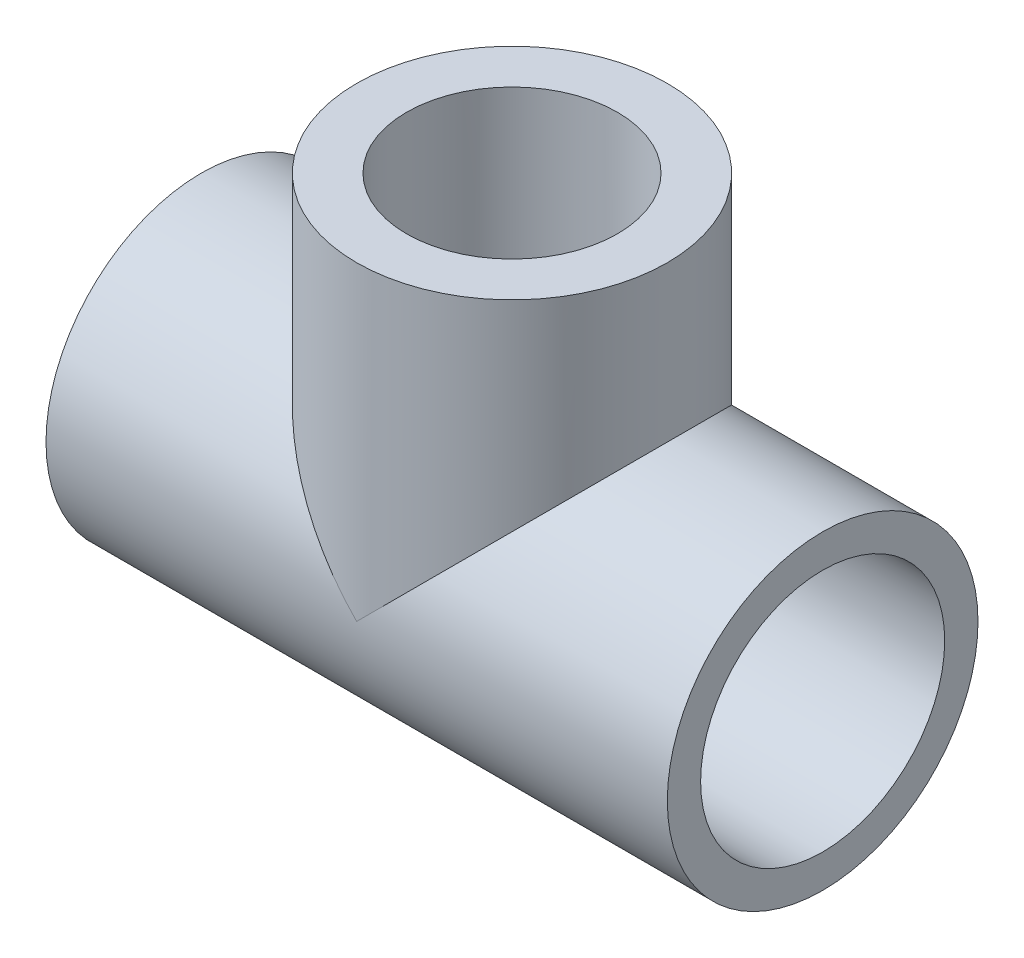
from build123d import *

# Parameters (mm, degrees)
SKETCH1_R                = 21.336
BOSS_EXTRUDE1_DEPTH      = 42.672
BOSS_EXTRUDE2_DEPTH      = 42.672
BOSS_EXTRUDE2_DEPTH_BACK = 42.672
SKETCH2_R                = 21.336
SKETCH3_R                = 14.478
CUT_EXTRUDE1_DEPTH       = 42.672
CUT_EXTRUDE3_REACH       = 99.774
SKETCH6_R                = 15.494
SKETCH4_R                = 16.764
CUT_EXTRUDE2_DEPTH       = 25.4


with BuildPart() as part:
    # Sketch1 → Boss-Extrude1 (new body)
    with BuildSketch(Plane(origin=(0, 0, 0), x_dir=(1, 0, 0), z_dir=(0, 1, 0))):
        with Locations(Location((0, 0, 0), (0, 0, 270))):
            Circle(SKETCH1_R)
    extrude(amount=BOSS_EXTRUDE1_DEPTH)

    # Sketch2 → Boss-Extrude2 (add, two sides: drawn at the far end of the back side and taken through both)
    with BuildSketch(Plane(origin=(0, 0, 0), x_dir=(0, 0, -1), z_dir=(1, 0, 0)).offset(-BOSS_EXTRUDE2_DEPTH_BACK)):
        Circle(SKETCH2_R)
    extrude(amount=BOSS_EXTRUDE2_DEPTH + BOSS_EXTRUDE2_DEPTH_BACK)

    # Sketch3 → Cut-Extrude1 (cut)
    with BuildSketch(Plane(origin=(0, 42.672, 0), x_dir=(1, 0, 0), z_dir=(0, 1, 0))):
        with Locations(Location((0, 0, 0), (0, 0, 270))):
            Circle(SKETCH3_R)
    extrude(amount=-CUT_EXTRUDE1_DEPTH, mode=Mode.SUBTRACT)

    # Cut-Extrude3: up to this face of the body (flat: up to its plane)
    cut_extrude3_end = Plane(part.part.faces().sort_by_distance((-42.672, 0, 0))[0])
    # Sketch6 → Cut-Extrude3 (cut, up to the picked face)
    with BuildSketch(Plane(origin=(42.672, 0, 0), x_dir=(0, 0, -1), z_dir=(1, 0, 0)), mode=Mode.PRIVATE) as cut_extrude3_sk1:
        Circle(SKETCH6_R)
    cut_extrude3_tool1 = split(extrude(cut_extrude3_sk1.sketch, amount=-CUT_EXTRUDE3_REACH, mode=Mode.PRIVATE), bisect_by=cut_extrude3_end, keep=Keep.BOTH, mode=Mode.PRIVATE)
    add(cut_extrude3_tool1.solids().sort_by(Axis((42.672, 0, 0), (-1, 0, 0)))[0], mode=Mode.SUBTRACT)

    # Sketch4 → Cut-Extrude2 (cut)
    with BuildSketch(Plane(origin=(42.672, 0, 0), x_dir=(0, 0, -1), z_dir=(1, 0, 0))):
        Circle(SKETCH4_R)
    cut_extrude2 = extrude(amount=-CUT_EXTRUDE2_DEPTH, mode=Mode.SUBTRACT)

    # Mirror1: Cut-Extrude2 across plane
    add(cut_extrude2.mirror(Plane(origin=(0, 0, 0), x_dir=(0, 0, 1), z_dir=(1, 0, 0))), mode=Mode.SUBTRACT)


solid = part.part
